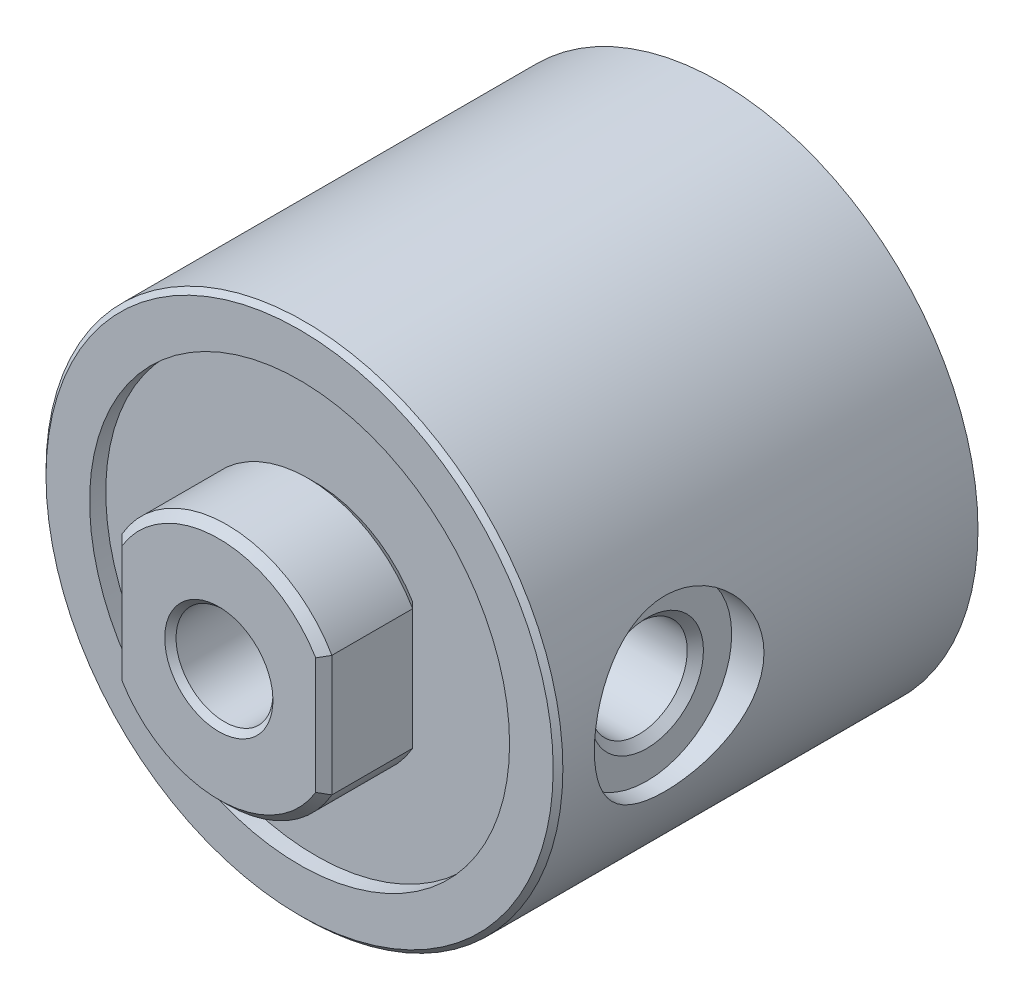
ISO-10303-21;
HEADER;
FILE_DESCRIPTION(('STEP AP214'),'2;1');
FILE_NAME('part.step','',(''),(''),'','','');
FILE_SCHEMA(('AUTOMOTIVE_DESIGN { 1 0 10303 214 1 1 1 1 }'));
ENDSEC;
DATA;
#1=APPLICATION_CONTEXT('core data for automotive mechanical design processes');
#2=APPLICATION_PROTOCOL_DEFINITION('international standard','automotive_design',2000,#1);
#3=PRODUCT_CONTEXT('',#1,'mechanical');
#4=PRODUCT('Part','Part','',(#3));
#5=PRODUCT_RELATED_PRODUCT_CATEGORY('part','',(#4));
#6=PRODUCT_DEFINITION_FORMATION('','',#4);
#7=PRODUCT_DEFINITION_CONTEXT('part definition',#1,'design');
#8=PRODUCT_DEFINITION('design','',#6,#7);
#9=PRODUCT_DEFINITION_SHAPE('','',#8);
#10=(LENGTH_UNIT() NAMED_UNIT(*) SI_UNIT(.MILLI.,.METRE.));
#11=(NAMED_UNIT(*) PLANE_ANGLE_UNIT() SI_UNIT($,.RADIAN.));
#12=(NAMED_UNIT(*) SI_UNIT($,.STERADIAN.) SOLID_ANGLE_UNIT());
#13=UNCERTAINTY_MEASURE_WITH_UNIT(LENGTH_MEASURE(1.E-05),#10,'distance_accuracy_value','');
#14=(GEOMETRIC_REPRESENTATION_CONTEXT(3) GLOBAL_UNCERTAINTY_ASSIGNED_CONTEXT((#13)) GLOBAL_UNIT_ASSIGNED_CONTEXT((#10,
#11,#12)) REPRESENTATION_CONTEXT('',''));
#15=CARTESIAN_POINT('',(0.,0.,0.));
#16=DIRECTION('',(0.,0.,1.));
#17=DIRECTION('',(1.,0.,0.));
#18=AXIS2_PLACEMENT_3D('',#15,#16,#17);
#19=CARTESIAN_POINT('',(6.,0.,18.5));
#20=DIRECTION('',(1.,0.,0.));
#21=DIRECTION('',(0.,0.,-1.));
#22=AXIS2_PLACEMENT_3D('',#19,#20,#21);
#23=CYLINDRICAL_SURFACE('',#22,5.25);
#24=CARTESIAN_POINT('',(14.,0.,18.5));
#25=DIRECTION('',(-1.,0.,0.));
#26=DIRECTION('',(0.,-1.,0.));
#27=AXIS2_PLACEMENT_3D('',#24,#25,#26);
#28=CIRCLE('',#27,5.25);
#29=CARTESIAN_POINT('',(14.,-5.25000000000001,18.5));
#30=VERTEX_POINT('',#29);
#31=EDGE_CURVE('E162',#30,#30,#28,.T.);
#32=ORIENTED_EDGE('',*,*,#31,.T.);
#33=EDGE_LOOP('',(#32));
#34=FACE_BOUND('',#33,.T.);
#35=CARTESIAN_POINT('',(16.,0.,13.25));
#36=CARTESIAN_POINT('',(16.0000001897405,-0.286709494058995,13.2499994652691));
#37=CARTESIAN_POINT('',(15.9922220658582,-0.573418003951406,13.2735628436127));
#38=CARTESIAN_POINT('',(15.9619585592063,-1.13840576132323,13.3669169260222));
#39=CARTESIAN_POINT('',(15.9394711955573,-1.41668386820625,13.4367138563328));
#40=CARTESIAN_POINT('',(15.8822364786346,-1.95658170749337,13.6198923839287));
#41=CARTESIAN_POINT('',(15.8475092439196,-2.21822794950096,13.7332024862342));
#42=CARTESIAN_POINT('',(15.7693480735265,-2.71880895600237,13.9998850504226));
#43=CARTESIAN_POINT('',(15.7259125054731,-2.95773945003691,14.15326502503));
#44=CARTESIAN_POINT('',(15.6332861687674,-3.41412925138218,14.5011154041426));
#45=CARTESIAN_POINT('',(15.5839607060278,-3.6307164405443,14.6966919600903));
#46=CARTESIAN_POINT('',(15.4858403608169,-4.02875232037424,15.121209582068));
#47=CARTESIAN_POINT('',(15.4370455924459,-4.21019359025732,15.3501576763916));
#48=CARTESIAN_POINT('',(15.3676517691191,-4.45451830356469,15.7175027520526));
#49=CARTESIAN_POINT('',(15.3448664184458,-4.5321901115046,15.8458879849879));
#50=CARTESIAN_POINT('',(15.301536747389,-4.67639137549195,16.1091118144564));
#51=CARTESIAN_POINT('',(15.2809915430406,-4.7429252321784,16.2439478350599));
#52=CARTESIAN_POINT('',(15.2427851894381,-4.86431443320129,16.5191964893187));
#53=CARTESIAN_POINT('',(15.2251245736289,-4.91916761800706,16.6596101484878));
#54=CARTESIAN_POINT('',(15.1932765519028,-5.01667019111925,16.9449330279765));
#55=CARTESIAN_POINT('',(15.1790875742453,-5.05932510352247,17.0898401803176));
#56=CARTESIAN_POINT('',(15.1550519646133,-5.13086527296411,17.37835336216));
#57=CARTESIAN_POINT('',(15.1450795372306,-5.16015188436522,17.521849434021));
#58=CARTESIAN_POINT('',(15.1291596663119,-5.20664321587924,17.8109495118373));
#59=CARTESIAN_POINT('',(15.123210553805,-5.22385294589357,17.9565526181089));
#60=CARTESIAN_POINT('',(15.1155308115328,-5.2460334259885,18.248790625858));
#61=CARTESIAN_POINT('',(15.1137999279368,-5.25100491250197,18.3954254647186));
#62=CARTESIAN_POINT('',(15.1146148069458,-5.24865901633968,18.6885827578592));
#63=CARTESIAN_POINT('',(15.1171604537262,-5.24134196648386,18.8351052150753));
#64=CARTESIAN_POINT('',(15.1262351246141,-5.21509263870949,19.1204141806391));
#65=CARTESIAN_POINT('',(15.1325824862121,-5.19668986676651,19.2592555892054));
#66=CARTESIAN_POINT('',(15.1489112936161,-5.1488953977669,19.5348641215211));
#67=CARTESIAN_POINT('',(15.1588939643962,-5.11949999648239,19.6716305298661));
#68=CARTESIAN_POINT('',(15.1821914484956,-5.04999045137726,19.9420764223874));
#69=CARTESIAN_POINT('',(15.1955053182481,-5.00987934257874,20.0757567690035));
#70=CARTESIAN_POINT('',(15.2250851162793,-4.91925343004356,20.3392574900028));
#71=CARTESIAN_POINT('',(15.2413521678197,-4.86873466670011,20.469076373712));
#72=CARTESIAN_POINT('',(15.2766495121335,-4.7568341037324,20.7259719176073));
#73=CARTESIAN_POINT('',(15.2957183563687,-4.69529758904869,20.8529759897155));
#74=CARTESIAN_POINT('',(15.3358955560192,-4.56236027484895,21.1013928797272));
#75=CARTESIAN_POINT('',(15.3570046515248,-4.49095589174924,21.2228036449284));
#76=CARTESIAN_POINT('',(15.422542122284,-4.26265776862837,21.5775304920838));
#77=CARTESIAN_POINT('',(15.4692078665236,-4.09159662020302,21.8015294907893));
#78=CARTESIAN_POINT('',(15.5660589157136,-3.70662777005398,22.2296799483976));
#79=CARTESIAN_POINT('',(15.6163029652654,-3.49099291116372,22.4322584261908));
#80=CARTESIAN_POINT('',(15.7126062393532,-3.02816716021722,22.798813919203));
#81=CARTESIAN_POINT('',(15.7586650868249,-2.78097342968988,22.9627874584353));
#82=CARTESIAN_POINT('',(15.8419744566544,-2.25882664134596,23.2486414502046));
#83=CARTESIAN_POINT('',(15.8791385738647,-1.98363559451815,23.3701139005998));
#84=CARTESIAN_POINT('',(15.9398466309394,-1.41521430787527,23.5645637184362));
#85=CARTESIAN_POINT('',(15.9633951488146,-1.121990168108,23.6375573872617));
#86=CARTESIAN_POINT('',(15.9934654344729,-0.539099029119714,23.7302264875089));
#87=CARTESIAN_POINT('',(16.0006630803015,-0.24980309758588,23.7520197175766));
#88=CARTESIAN_POINT('',(15.9992404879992,0.328362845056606,23.747686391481));
#89=CARTESIAN_POINT('',(15.9906228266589,0.617232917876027,23.7215676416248));
#90=CARTESIAN_POINT('',(15.958984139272,1.17794733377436,23.6238366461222));
#91=CARTESIAN_POINT('',(15.9363716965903,1.45004183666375,23.5535140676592));
#92=CARTESIAN_POINT('',(15.8794304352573,1.97847602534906,23.3709640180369));
#93=CARTESIAN_POINT('',(15.8451001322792,2.2348137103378,23.2587312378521));
#94=CARTESIAN_POINT('',(15.7671241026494,2.73180727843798,22.9923622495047));
#95=CARTESIAN_POINT('',(15.7232605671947,2.97188670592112,22.8372180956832));
#96=CARTESIAN_POINT('',(15.6311726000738,3.42338661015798,22.4904754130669));
#97=CARTESIAN_POINT('',(15.5829468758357,3.6347985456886,22.2988660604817));
#98=CARTESIAN_POINT('',(15.5099889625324,3.93080686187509,21.9832982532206));
#99=CARTESIAN_POINT('',(15.4850337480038,4.02775652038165,21.8707214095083));
#100=CARTESIAN_POINT('',(15.4359782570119,4.21184399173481,21.6376565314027));
#101=CARTESIAN_POINT('',(15.4118776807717,4.29898526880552,21.5171713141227));
#102=CARTESIAN_POINT('',(15.3652178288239,4.46288622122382,21.2689852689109));
#103=CARTESIAN_POINT('',(15.3426592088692,4.5396414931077,21.1412814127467));
#104=CARTESIAN_POINT('',(15.2997778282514,4.68212907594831,20.8795698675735));
#105=CARTESIAN_POINT('',(15.2794541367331,4.74786598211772,20.7455648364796));
#106=CARTESIAN_POINT('',(15.2417045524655,4.86768768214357,20.4723882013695));
#107=CARTESIAN_POINT('',(15.2242726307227,4.92179679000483,20.3332281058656));
#108=CARTESIAN_POINT('',(15.1928226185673,5.01803804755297,20.0505099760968));
#109=CARTESIAN_POINT('',(15.1788031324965,5.06017509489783,19.9069537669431));
#110=CARTESIAN_POINT('',(15.1546390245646,5.13209093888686,19.6164790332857));
#111=CARTESIAN_POINT('',(15.1444937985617,5.16187166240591,19.4695610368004));
#112=CARTESIAN_POINT('',(15.1284251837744,5.20877809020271,19.1734921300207));
#113=CARTESIAN_POINT('',(15.1225015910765,5.22590440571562,19.0243413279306));
#114=CARTESIAN_POINT('',(15.1152688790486,5.24678567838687,18.7325064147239));
#115=CARTESIAN_POINT('',(15.1137437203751,5.25116674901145,18.5898721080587));
#116=CARTESIAN_POINT('',(15.1147381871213,5.24830378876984,18.3046839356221));
#117=CARTESIAN_POINT('',(15.1172591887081,5.24105580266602,18.1621301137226));
#118=CARTESIAN_POINT('',(15.1262661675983,5.21500339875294,17.8782731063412));
#119=CARTESIAN_POINT('',(15.1327504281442,5.19620398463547,17.7369694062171));
#120=CARTESIAN_POINT('',(15.1494797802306,5.1472255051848,17.4565239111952));
#121=CARTESIAN_POINT('',(15.159726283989,5.11704216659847,17.3173829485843));
#122=CARTESIAN_POINT('',(15.1834458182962,5.04622046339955,17.044796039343));
#123=CARTESIAN_POINT('',(15.1968565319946,5.00578302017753,16.9112924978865));
#124=CARTESIAN_POINT('',(15.2266068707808,4.91454331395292,16.6481951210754));
#125=CARTESIAN_POINT('',(15.2429475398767,4.86373735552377,16.5186026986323));
#126=CARTESIAN_POINT('',(15.2956907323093,4.69633894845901,16.1369666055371));
#127=CARTESIAN_POINT('',(15.335834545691,4.56470890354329,15.8918461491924));
#128=CARTESIAN_POINT('',(15.4236656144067,4.25873630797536,15.416320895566));
#129=CARTESIAN_POINT('',(15.4716009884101,4.08281598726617,15.1869845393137));
#130=CARTESIAN_POINT('',(15.5685600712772,3.69589864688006,14.760243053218));
#131=CARTESIAN_POINT('',(15.6175840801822,3.48489185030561,14.562846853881));
#132=CARTESIAN_POINT('',(15.7133890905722,3.02434678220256,14.1982256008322));
#133=CARTESIAN_POINT('',(15.7600181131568,2.77366444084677,14.0324013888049));
#134=CARTESIAN_POINT('',(15.8437522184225,2.24646513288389,13.7454351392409));
#135=CARTESIAN_POINT('',(15.8808600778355,1.969955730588,13.6242800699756));
#136=CARTESIAN_POINT('',(15.9396537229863,1.41459012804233,13.4361463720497));
#137=CARTESIAN_POINT('',(15.9620741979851,1.13669576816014,13.3665591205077));
#138=CARTESIAN_POINT('',(15.9922453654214,0.572532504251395,13.2734920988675));
#139=CARTESIAN_POINT('',(15.9999998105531,0.286265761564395,13.2500005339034));
#140=CARTESIAN_POINT('',(16.,0.,13.25));
#141=B_SPLINE_CURVE_WITH_KNOTS('',3,(#35,#36,#37,#38,#39,#40,#41,#42,#43,#44,#45,#46,#47,#48,
#49,#50,#51,#52,#53,#54,#55,#56,#57,#58,#59,#60,#61,#62,#63,#64,#65,#66,#67,#68,#69,#70,#71,#72,
#73,#74,#75,#76,#77,#78,#79,#80,#81,#82,#83,#84,#85,#86,#87,#88,#89,#90,#91,#92,#93,#94,#95,#96,
#97,#98,#99,#100,#101,#102,#103,#104,#105,#106,#107,#108,#109,#110,#111,#112,#113,#114,#115,
#116,#117,#118,#119,#120,#121,#122,#123,#124,#125,#126,#127,#128,#129,#130,#131,#132,#133,#134,
#135,#136,#137,#138,#139,#140),.UNSPECIFIED.,.T.,.F.,(4,2,2,2,2,2,2,2,2,2,2,2,2,2,2,2,2,2,2,2,2,
2,2,2,2,2,2,2,2,2,2,2,2,2,2,2,2,2,2,2,2,2,2,2,2,2,2,2,2,2,2,2,4),(0.,0.859075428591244,
1.71826657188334,2.57605200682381,3.43399838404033,4.31799257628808,5.20217321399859,
5.65702442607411,6.11169549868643,6.56645055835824,7.02099935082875,7.46082097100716,
7.90046003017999,8.34007263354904,8.77967333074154,9.19977850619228,9.62002537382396,
10.0401533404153,10.4604414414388,10.8871751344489,11.3140642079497,12.1672273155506,
13.0634636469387,13.9597806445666,14.8644801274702,15.7688752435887,16.6351478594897,
17.5012793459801,18.3432445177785,19.1853163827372,20.0491497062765,20.9132398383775,
21.3647510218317,21.8161022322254,22.2676442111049,22.7189974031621,23.1693974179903,
23.6196129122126,24.0697581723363,24.5198816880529,24.9474850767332,25.3752339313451,
25.8027976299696,26.2305219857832,26.6504379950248,27.0705039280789,27.9099651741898,
28.7851100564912,29.6604992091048,30.5685564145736,31.476348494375,32.3343139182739,
33.1920597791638),.UNSPECIFIED.);
#142=CARTESIAN_POINT('',(16.,0.,13.25));
#143=VERTEX_POINT('',#142);
#144=EDGE_CURVE('E158',#143,#143,#141,.T.);
#145=ORIENTED_EDGE('',*,*,#144,.F.);
#146=EDGE_LOOP('',(#145));
#147=FACE_BOUND('',#146,.T.);
#148=ADVANCED_FACE('F14',(#34,#147),#23,.F.);
#149=CARTESIAN_POINT('',(14.,0.,18.5));
#150=DIRECTION('',(-1.,0.,0.));
#151=DIRECTION('',(0.,-1.,0.));
#152=AXIS2_PLACEMENT_3D('',#149,#150,#151);
#153=PLANE('',#152);
#154=CARTESIAN_POINT('',(14.,0.,18.5));
#155=DIRECTION('',(1.,0.,0.));
#156=DIRECTION('',(0.,-1.,0.));
#157=AXIS2_PLACEMENT_3D('',#154,#155,#156);
#158=CIRCLE('',#157,3.5);
#159=CARTESIAN_POINT('',(14.,-3.50000000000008,18.5));
#160=VERTEX_POINT('',#159);
#161=EDGE_CURVE('E163',#160,#160,#158,.F.);
#162=ORIENTED_EDGE('',*,*,#161,.T.);
#163=EDGE_LOOP('',(#162));
#164=FACE_BOUND('',#163,.T.);
#165=ORIENTED_EDGE('',*,*,#31,.F.);
#166=EDGE_LOOP('',(#165));
#167=FACE_BOUND('',#166,.T.);
#168=ADVANCED_FACE('F199',(#164,#167),#153,.F.);
#169=CARTESIAN_POINT('',(0.,0.,31.));
#170=DIRECTION('',(0.,0.,1.));
#171=DIRECTION('',(0.,-1.,0.));
#172=AXIS2_PLACEMENT_3D('',#169,#170,#171);
#173=CONICAL_SURFACE('',#172,3.35,0.785398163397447);
#174=CARTESIAN_POINT('',(0.,0.,30.65));
#175=DIRECTION('',(0.,0.,1.));
#176=DIRECTION('',(-1.,0.,0.));
#177=AXIS2_PLACEMENT_3D('',#174,#175,#176);
#178=CIRCLE('',#177,3.);
#179=CARTESIAN_POINT('',(-3.,0.,30.65));
#180=VERTEX_POINT('',#179);
#181=EDGE_CURVE('E18',#180,#180,#178,.F.);
#182=ORIENTED_EDGE('',*,*,#181,.T.);
#183=EDGE_LOOP('',(#182));
#184=FACE_BOUND('',#183,.T.);
#185=CARTESIAN_POINT('',(0.,0.,31.));
#186=DIRECTION('',(0.,0.,1.));
#187=DIRECTION('',(0.,-1.,0.));
#188=AXIS2_PLACEMENT_3D('',#185,#186,#187);
#189=CIRCLE('',#188,3.35);
#190=CARTESIAN_POINT('',(0.,-3.35,31.));
#191=VERTEX_POINT('',#190);
#192=EDGE_CURVE('E165',#191,#191,#189,.T.);
#193=ORIENTED_EDGE('',*,*,#192,.T.);
#194=EDGE_LOOP('',(#193));
#195=FACE_BOUND('',#194,.T.);
#196=ADVANCED_FACE('F227',(#184,#195),#173,.F.);
#197=CARTESIAN_POINT('',(0.,-7.5,31.));
#198=DIRECTION('',(0.,0.,-1.));
#199=DIRECTION('',(0.,1.,0.));
#200=AXIS2_PLACEMENT_3D('',#197,#198,#199);
#201=PLANE('',#200);
#202=ORIENTED_EDGE('',*,*,#192,.F.);
#203=EDGE_LOOP('',(#202));
#204=FACE_BOUND('',#203,.T.);
#205=CARTESIAN_POINT('',(0.,0.,31.));
#206=DIRECTION('',(0.,0.,-1.));
#207=DIRECTION('',(0.,1.,0.));
#208=AXIS2_PLACEMENT_3D('',#205,#206,#207);
#209=CIRCLE('',#208,7.);
#210=CARTESIAN_POINT('',(-6.,-3.60555127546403,31.));
#211=VERTEX_POINT('',#210);
#212=CARTESIAN_POINT('',(6.,-3.60555127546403,31.));
#213=VERTEX_POINT('',#212);
#214=EDGE_CURVE('E120',#211,#213,#209,.F.);
#215=ORIENTED_EDGE('',*,*,#214,.T.);
#216=DIRECTION('',(0.,1.,0.));
#217=VECTOR('',#216,1.);
#218=CARTESIAN_POINT('',(6.,-7.5,31.));
#219=LINE('',#218,#217);
#220=CARTESIAN_POINT('',(6.,3.60555127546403,31.));
#221=VERTEX_POINT('',#220);
#222=EDGE_CURVE('E104',#213,#221,#219,.T.);
#223=ORIENTED_EDGE('',*,*,#222,.T.);
#224=CARTESIAN_POINT('',(0.,0.,31.));
#225=DIRECTION('',(0.,0.,-1.));
#226=DIRECTION('',(0.,1.,0.));
#227=AXIS2_PLACEMENT_3D('',#224,#225,#226);
#228=CIRCLE('',#227,7.);
#229=CARTESIAN_POINT('',(-6.,3.60555127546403,31.));
#230=VERTEX_POINT('',#229);
#231=EDGE_CURVE('E127',#221,#230,#228,.F.);
#232=ORIENTED_EDGE('',*,*,#231,.T.);
#233=DIRECTION('',(0.,-1.,0.));
#234=VECTOR('',#233,1.);
#235=CARTESIAN_POINT('',(-6.,-7.5,31.));
#236=LINE('',#235,#234);
#237=EDGE_CURVE('E122',#230,#211,#236,.T.);
#238=ORIENTED_EDGE('',*,*,#237,.T.);
#239=EDGE_LOOP('',(#215,#223,#232,#238));
#240=FACE_BOUND('',#239,.T.);
#241=ADVANCED_FACE('F233',(#204,#240),#201,.F.);
#242=CARTESIAN_POINT('',(6.5,7.41559238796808,30.5));
#243=DIRECTION('',(-0.707106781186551,0.,-0.707106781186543));
#244=DIRECTION('',(0.707106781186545,0.,-0.707106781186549));
#245=AXIS2_PLACEMENT_3D('',#242,#243,#244);
#246=PLANE('',#245);
#247=CARTESIAN_POINT('',(6.,3.60555127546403,31.));
#248=CARTESIAN_POINT('',(6.08327819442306,3.62864080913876,30.9167218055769));
#249=CARTESIAN_POINT('',(6.16658396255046,3.65152775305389,30.8334160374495));
#250=CARTESIAN_POINT('',(6.33325062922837,3.6968964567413,30.6667493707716));
#251=CARTESIAN_POINT('',(6.41661152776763,3.71937821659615,30.5833884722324));
#252=CARTESIAN_POINT('',(6.5,3.741657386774,30.5));
#253=B_SPLINE_CURVE_WITH_KNOTS('',3,(#247,#248,#249,#250,#251,#252),.UNSPECIFIED.,.F.,.F.,(4,2,
4),(0.,0.360043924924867,0.720087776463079),.UNSPECIFIED.);
#254=CARTESIAN_POINT('',(6.5,3.74165738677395,30.5));
#255=VERTEX_POINT('',#254);
#256=EDGE_CURVE('E107',#255,#221,#253,.F.);
#257=ORIENTED_EDGE('',*,*,#256,.T.);
#258=ORIENTED_EDGE('',*,*,#222,.F.);
#259=CARTESIAN_POINT('',(6.5,-3.74165738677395,30.5));
#260=CARTESIAN_POINT('',(6.41661152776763,-3.71937821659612,30.5833884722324));
#261=CARTESIAN_POINT('',(6.33325062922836,-3.69689645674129,30.6667493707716));
#262=CARTESIAN_POINT('',(6.16658396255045,-3.65152775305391,30.8334160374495));
#263=CARTESIAN_POINT('',(6.08327819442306,-3.62864080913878,30.9167218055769));
#264=CARTESIAN_POINT('',(6.,-3.60555127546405,31.));
#265=B_SPLINE_CURVE_WITH_KNOTS('',3,(#259,#260,#261,#262,#263,#264),.UNSPECIFIED.,.F.,.F.,(4,2,
4),(0.,0.360043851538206,0.720087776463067),.UNSPECIFIED.);
#266=CARTESIAN_POINT('',(6.5,-3.74165738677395,30.5));
#267=VERTEX_POINT('',#266);
#268=EDGE_CURVE('E100',#213,#267,#265,.F.);
#269=ORIENTED_EDGE('',*,*,#268,.T.);
#270=DIRECTION('',(0.,-1.,0.));
#271=VECTOR('',#270,1.);
#272=CARTESIAN_POINT('',(6.5,7.41559238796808,30.5));
#273=LINE('',#272,#271);
#274=EDGE_CURVE('E102',#255,#267,#273,.T.);
#275=ORIENTED_EDGE('',*,*,#274,.F.);
#276=EDGE_LOOP('',(#257,#258,#269,#275));
#277=FACE_BOUND('',#276,.T.);
#278=ADVANCED_FACE('F101',(#277),#246,.F.);
#279=CARTESIAN_POINT('',(0.,0.,30.5));
#280=DIRECTION('',(0.,0.,-1.));
#281=DIRECTION('',(0.,1.,0.));
#282=AXIS2_PLACEMENT_3D('',#279,#280,#281);
#283=CONICAL_SURFACE('',#282,7.5,0.785398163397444);
#284=CARTESIAN_POINT('',(-6.,3.60555127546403,31.));
#285=CARTESIAN_POINT('',(-6.08327819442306,3.62864080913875,30.9167218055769));
#286=CARTESIAN_POINT('',(-6.16658396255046,3.65152775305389,30.8334160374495));
#287=CARTESIAN_POINT('',(-6.33325062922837,3.6968964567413,30.6667493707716));
#288=CARTESIAN_POINT('',(-6.41661152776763,3.71937821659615,30.5833884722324));
#289=CARTESIAN_POINT('',(-6.5,3.741657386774,30.5));
#290=B_SPLINE_CURVE_WITH_KNOTS('',3,(#284,#285,#286,#287,#288,#289),.UNSPECIFIED.,.F.,.F.,(4,2,
4),(0.,0.360043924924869,0.720087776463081),.UNSPECIFIED.);
#291=CARTESIAN_POINT('',(-6.5,3.74165738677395,30.5));
#292=VERTEX_POINT('',#291);
#293=EDGE_CURVE('E289',#292,#230,#290,.F.);
#294=ORIENTED_EDGE('',*,*,#293,.T.);
#295=ORIENTED_EDGE('',*,*,#231,.F.);
#296=ORIENTED_EDGE('',*,*,#256,.F.);
#297=CARTESIAN_POINT('',(0.,0.,30.5));
#298=DIRECTION('',(0.,0.,-1.));
#299=DIRECTION('',(0.,1.,0.));
#300=AXIS2_PLACEMENT_3D('',#297,#298,#299);
#301=CIRCLE('',#300,7.5);
#302=EDGE_CURVE('E130',#292,#255,#301,.T.);
#303=ORIENTED_EDGE('',*,*,#302,.F.);
#304=EDGE_LOOP('',(#294,#295,#296,#303));
#305=FACE_BOUND('',#304,.T.);
#306=ADVANCED_FACE('F276',(#305),#283,.T.);
#307=CARTESIAN_POINT('',(-6.5,7.41559238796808,30.5));
#308=DIRECTION('',(0.707106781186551,0.,-0.707106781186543));
#309=DIRECTION('',(0.707106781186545,0.,0.707106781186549));
#310=AXIS2_PLACEMENT_3D('',#307,#308,#309);
#311=PLANE('',#310);
#312=CARTESIAN_POINT('',(-6.,-3.60555127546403,31.));
#313=CARTESIAN_POINT('',(-6.08327819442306,-3.62864080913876,30.9167218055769));
#314=CARTESIAN_POINT('',(-6.16658396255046,-3.65152775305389,30.8334160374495));
#315=CARTESIAN_POINT('',(-6.33325062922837,-3.69689645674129,30.6667493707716));
#316=CARTESIAN_POINT('',(-6.41661152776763,-3.71937821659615,30.5833884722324));
#317=CARTESIAN_POINT('',(-6.5,-3.741657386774,30.5));
#318=B_SPLINE_CURVE_WITH_KNOTS('',3,(#312,#313,#314,#315,#316,#317),.UNSPECIFIED.,.F.,.F.,(4,2,
4),(0.,0.360043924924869,0.720087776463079),.UNSPECIFIED.);
#319=CARTESIAN_POINT('',(-6.5,-3.74165738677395,30.5));
#320=VERTEX_POINT('',#319);
#321=EDGE_CURVE('E113',#211,#320,#318,.T.);
#322=ORIENTED_EDGE('',*,*,#321,.F.);
#323=ORIENTED_EDGE('',*,*,#237,.F.);
#324=ORIENTED_EDGE('',*,*,#293,.F.);
#325=DIRECTION('',(0.,1.,0.));
#326=VECTOR('',#325,1.);
#327=CARTESIAN_POINT('',(-6.5,7.41559238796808,30.5));
#328=LINE('',#327,#326);
#329=EDGE_CURVE('E115',#320,#292,#328,.T.);
#330=ORIENTED_EDGE('',*,*,#329,.F.);
#331=EDGE_LOOP('',(#322,#323,#324,#330));
#332=FACE_BOUND('',#331,.T.);
#333=ADVANCED_FACE('F253',(#332),#311,.F.);
#334=CARTESIAN_POINT('',(0.,0.,30.5));
#335=DIRECTION('',(0.,0.,-1.));
#336=DIRECTION('',(0.,1.,0.));
#337=AXIS2_PLACEMENT_3D('',#334,#335,#336);
#338=CONICAL_SURFACE('',#337,7.5,0.785398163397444);
#339=ORIENTED_EDGE('',*,*,#321,.T.);
#340=CARTESIAN_POINT('',(0.,0.,30.5));
#341=DIRECTION('',(0.,0.,-1.));
#342=DIRECTION('',(0.,1.,0.));
#343=AXIS2_PLACEMENT_3D('',#340,#341,#342);
#344=CIRCLE('',#343,7.5);
#345=EDGE_CURVE('E86',#267,#320,#344,.T.);
#346=ORIENTED_EDGE('',*,*,#345,.F.);
#347=ORIENTED_EDGE('',*,*,#268,.F.);
#348=ORIENTED_EDGE('',*,*,#214,.F.);
#349=EDGE_LOOP('',(#339,#346,#347,#348));
#350=FACE_BOUND('',#349,.T.);
#351=ADVANCED_FACE('F111',(#350),#338,.T.);
#352=CARTESIAN_POINT('',(6.5,7.41559238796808,-0.499999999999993));
#353=DIRECTION('',(-1.,0.,0.));
#354=DIRECTION('',(0.,0.,-1.));
#355=AXIS2_PLACEMENT_3D('',#352,#353,#354);
#356=PLANE('',#355);
#357=DIRECTION('',(0.,0.,-1.));
#358=VECTOR('',#357,1.);
#359=CARTESIAN_POINT('',(6.5,-3.74165738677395,-0.499999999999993));
#360=LINE('',#359,#358);
#361=CARTESIAN_POINT('',(6.5,-3.74165738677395,25.5));
#362=VERTEX_POINT('',#361);
#363=EDGE_CURVE('E82',#362,#267,#360,.F.);
#364=ORIENTED_EDGE('',*,*,#363,.F.);
#365=DIRECTION('',(0.,1.,0.));
#366=VECTOR('',#365,1.);
#367=CARTESIAN_POINT('',(6.5,7.41559238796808,25.5));
#368=LINE('',#367,#366);
#369=CARTESIAN_POINT('',(6.5,3.74165738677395,25.5));
#370=VERTEX_POINT('',#369);
#371=EDGE_CURVE('E144',#362,#370,#368,.T.);
#372=ORIENTED_EDGE('',*,*,#371,.T.);
#373=DIRECTION('',(0.,0.,-1.));
#374=VECTOR('',#373,1.);
#375=CARTESIAN_POINT('',(6.5,3.74165738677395,-0.499999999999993));
#376=LINE('',#375,#374);
#377=EDGE_CURVE('E93',#255,#370,#376,.T.);
#378=ORIENTED_EDGE('',*,*,#377,.F.);
#379=ORIENTED_EDGE('',*,*,#274,.T.);
#380=EDGE_LOOP('',(#364,#372,#378,#379));
#381=FACE_BOUND('',#380,.T.);
#382=ADVANCED_FACE('F118',(#381),#356,.F.);
#383=CARTESIAN_POINT('',(0.,0.,-0.499999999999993));
#384=DIRECTION('',(0.,0.,-1.));
#385=DIRECTION('',(0.,1.,0.));
#386=AXIS2_PLACEMENT_3D('',#383,#384,#385);
#387=CYLINDRICAL_SURFACE('',#386,7.5);
#388=ORIENTED_EDGE('',*,*,#377,.T.);
#389=CARTESIAN_POINT('',(0.,0.,25.5));
#390=DIRECTION('',(0.,0.,1.));
#391=DIRECTION('',(0.,-1.,0.));
#392=AXIS2_PLACEMENT_3D('',#389,#390,#391);
#393=CIRCLE('',#392,7.5);
#394=CARTESIAN_POINT('',(-6.5,3.74165738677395,25.5));
#395=VERTEX_POINT('',#394);
#396=EDGE_CURVE('E39',#370,#395,#393,.T.);
#397=ORIENTED_EDGE('',*,*,#396,.T.);
#398=DIRECTION('',(0.,0.,-1.));
#399=VECTOR('',#398,1.);
#400=CARTESIAN_POINT('',(-6.5,3.74165738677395,-0.499999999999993));
#401=LINE('',#400,#399);
#402=EDGE_CURVE('E296',#395,#292,#401,.F.);
#403=ORIENTED_EDGE('',*,*,#402,.T.);
#404=ORIENTED_EDGE('',*,*,#302,.T.);
#405=EDGE_LOOP('',(#388,#397,#403,#404));
#406=FACE_BOUND('',#405,.T.);
#407=ADVANCED_FACE('F254',(#406),#387,.T.);
#408=CARTESIAN_POINT('',(-6.5,7.41559238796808,-0.499999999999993));
#409=DIRECTION('',(1.,0.,0.));
#410=DIRECTION('',(0.,0.,1.));
#411=AXIS2_PLACEMENT_3D('',#408,#409,#410);
#412=PLANE('',#411);
#413=ORIENTED_EDGE('',*,*,#402,.F.);
#414=DIRECTION('',(0.,-1.,0.));
#415=VECTOR('',#414,1.);
#416=CARTESIAN_POINT('',(-6.5,7.41559238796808,25.5));
#417=LINE('',#416,#415);
#418=CARTESIAN_POINT('',(-6.5,-3.74165738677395,25.5));
#419=VERTEX_POINT('',#418);
#420=EDGE_CURVE('E31',#395,#419,#417,.T.);
#421=ORIENTED_EDGE('',*,*,#420,.T.);
#422=DIRECTION('',(0.,0.,-1.));
#423=VECTOR('',#422,1.);
#424=CARTESIAN_POINT('',(-6.5,-3.74165738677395,-0.499999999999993));
#425=LINE('',#424,#423);
#426=EDGE_CURVE('E94',#320,#419,#425,.T.);
#427=ORIENTED_EDGE('',*,*,#426,.F.);
#428=ORIENTED_EDGE('',*,*,#329,.T.);
#429=EDGE_LOOP('',(#413,#421,#427,#428));
#430=FACE_BOUND('',#429,.T.);
#431=ADVANCED_FACE('F257',(#430),#412,.F.);
#432=ORIENTED_EDGE('',*,*,#426,.T.);
#433=CARTESIAN_POINT('',(0.,0.,25.5));
#434=DIRECTION('',(0.,0.,1.));
#435=DIRECTION('',(0.,-1.,0.));
#436=AXIS2_PLACEMENT_3D('',#433,#434,#435);
#437=CIRCLE('',#436,7.5);
#438=EDGE_CURVE('E88',#419,#362,#437,.T.);
#439=ORIENTED_EDGE('',*,*,#438,.T.);
#440=ORIENTED_EDGE('',*,*,#363,.T.);
#441=ORIENTED_EDGE('',*,*,#345,.T.);
#442=EDGE_LOOP('',(#432,#439,#440,#441));
#443=FACE_BOUND('',#442,.T.);
#444=ADVANCED_FACE('F84',(#443),#387,.T.);
#445=CARTESIAN_POINT('',(6.,-4.5,25.));
#446=DIRECTION('',(-0.70710678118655,0.,0.707106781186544));
#447=DIRECTION('',(-0.707106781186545,0.,-0.707106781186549));
#448=AXIS2_PLACEMENT_3D('',#445,#446,#447);
#449=PLANE('',#448);
#450=CARTESIAN_POINT('',(6.5,3.74165738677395,25.5));
#451=CARTESIAN_POINT('',(6.41661152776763,3.71937821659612,25.4166115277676));
#452=CARTESIAN_POINT('',(6.33325062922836,3.69689645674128,25.3332506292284));
#453=CARTESIAN_POINT('',(6.16658396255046,3.6515277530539,25.1665839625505));
#454=CARTESIAN_POINT('',(6.08327819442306,3.62864080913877,25.0832781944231));
#455=CARTESIAN_POINT('',(6.,3.60555127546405,25.));
#456=B_SPLINE_CURVE_WITH_KNOTS('',3,(#450,#451,#452,#453,#454,#455),.UNSPECIFIED.,.F.,.F.,(4,2,
4),(0.,0.360043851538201,0.720087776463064),.UNSPECIFIED.);
#457=CARTESIAN_POINT('',(6.,3.60555127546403,25.));
#458=VERTEX_POINT('',#457);
#459=EDGE_CURVE('E307',#458,#370,#456,.F.);
#460=ORIENTED_EDGE('',*,*,#459,.T.);
#461=ORIENTED_EDGE('',*,*,#371,.F.);
#462=CARTESIAN_POINT('',(6.,-3.60555127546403,25.));
#463=CARTESIAN_POINT('',(6.08327819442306,-3.62864080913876,25.0832781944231));
#464=CARTESIAN_POINT('',(6.16658396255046,-3.65152775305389,25.1665839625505));
#465=CARTESIAN_POINT('',(6.33325062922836,-3.6968964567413,25.3332506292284));
#466=CARTESIAN_POINT('',(6.41661152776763,-3.71937821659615,25.4166115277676));
#467=CARTESIAN_POINT('',(6.5,-3.741657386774,25.5));
#468=B_SPLINE_CURVE_WITH_KNOTS('',3,(#462,#463,#464,#465,#466,#467),.UNSPECIFIED.,.F.,.F.,(4,2,
4),(0.,0.360043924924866,0.720087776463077),.UNSPECIFIED.);
#469=CARTESIAN_POINT('',(6.,-3.60555127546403,25.));
#470=VERTEX_POINT('',#469);
#471=EDGE_CURVE('E311',#362,#470,#468,.F.);
#472=ORIENTED_EDGE('',*,*,#471,.T.);
#473=DIRECTION('',(0.,-1.,0.));
#474=VECTOR('',#473,1.);
#475=CARTESIAN_POINT('',(6.,-4.5,25.));
#476=LINE('',#475,#474);
#477=EDGE_CURVE('E141',#458,#470,#476,.T.);
#478=ORIENTED_EDGE('',*,*,#477,.F.);
#479=EDGE_LOOP('',(#460,#461,#472,#478));
#480=FACE_BOUND('',#479,.T.);
#481=ADVANCED_FACE('F213',(#480),#449,.F.);
#482=CARTESIAN_POINT('',(0.,0.,25.));
#483=DIRECTION('',(0.,0.,1.));
#484=DIRECTION('',(0.,-1.,0.));
#485=AXIS2_PLACEMENT_3D('',#482,#483,#484);
#486=CONICAL_SURFACE('',#485,7.,0.785398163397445);
#487=CARTESIAN_POINT('',(-6.5,3.74165738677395,25.5));
#488=CARTESIAN_POINT('',(-6.41661152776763,3.71937821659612,25.4166115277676));
#489=CARTESIAN_POINT('',(-6.33325062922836,3.69689645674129,25.3332506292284));
#490=CARTESIAN_POINT('',(-6.16658396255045,3.65152775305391,25.1665839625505));
#491=CARTESIAN_POINT('',(-6.08327819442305,3.62864080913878,25.0832781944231));
#492=CARTESIAN_POINT('',(-6.,3.60555127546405,25.));
#493=B_SPLINE_CURVE_WITH_KNOTS('',3,(#487,#488,#489,#490,#491,#492),.UNSPECIFIED.,.F.,.F.,(4,2,
4),(0.,0.360043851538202,0.720087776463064),.UNSPECIFIED.);
#494=CARTESIAN_POINT('',(-6.,3.60555127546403,25.));
#495=VERTEX_POINT('',#494);
#496=EDGE_CURVE('E108',#495,#395,#493,.F.);
#497=ORIENTED_EDGE('',*,*,#496,.T.);
#498=ORIENTED_EDGE('',*,*,#396,.F.);
#499=ORIENTED_EDGE('',*,*,#459,.F.);
#500=CARTESIAN_POINT('',(0.,0.,25.));
#501=DIRECTION('',(0.,0.,1.));
#502=DIRECTION('',(0.,-1.,0.));
#503=AXIS2_PLACEMENT_3D('',#500,#501,#502);
#504=CIRCLE('',#503,7.);
#505=EDGE_CURVE('E138',#495,#458,#504,.F.);
#506=ORIENTED_EDGE('',*,*,#505,.F.);
#507=EDGE_LOOP('',(#497,#498,#499,#506));
#508=FACE_BOUND('',#507,.T.);
#509=ADVANCED_FACE('F270',(#508),#486,.T.);
#510=CARTESIAN_POINT('',(-6.,-4.5,25.));
#511=DIRECTION('',(0.70710678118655,0.,0.707106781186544));
#512=DIRECTION('',(-0.707106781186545,0.,0.707106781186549));
#513=AXIS2_PLACEMENT_3D('',#510,#511,#512);
#514=PLANE('',#513);
#515=CARTESIAN_POINT('',(-6.5,-3.74165738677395,25.5));
#516=CARTESIAN_POINT('',(-6.41661152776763,-3.71937821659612,25.4166115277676));
#517=CARTESIAN_POINT('',(-6.33325062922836,-3.69689645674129,25.3332506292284));
#518=CARTESIAN_POINT('',(-6.16658396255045,-3.65152775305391,25.1665839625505));
#519=CARTESIAN_POINT('',(-6.08327819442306,-3.62864080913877,25.0832781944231));
#520=CARTESIAN_POINT('',(-6.,-3.60555127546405,25.));
#521=B_SPLINE_CURVE_WITH_KNOTS('',3,(#515,#516,#517,#518,#519,#520),.UNSPECIFIED.,.F.,.F.,(4,2,
4),(0.,0.360043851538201,0.720087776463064),.UNSPECIFIED.);
#522=CARTESIAN_POINT('',(-6.,-3.60555127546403,25.));
#523=VERTEX_POINT('',#522);
#524=EDGE_CURVE('E302',#419,#523,#521,.T.);
#525=ORIENTED_EDGE('',*,*,#524,.F.);
#526=ORIENTED_EDGE('',*,*,#420,.F.);
#527=ORIENTED_EDGE('',*,*,#496,.F.);
#528=DIRECTION('',(0.,1.,0.));
#529=VECTOR('',#528,1.);
#530=CARTESIAN_POINT('',(-6.,-4.5,25.));
#531=LINE('',#530,#529);
#532=EDGE_CURVE('E136',#523,#495,#531,.T.);
#533=ORIENTED_EDGE('',*,*,#532,.F.);
#534=EDGE_LOOP('',(#525,#526,#527,#533));
#535=FACE_BOUND('',#534,.T.);
#536=ADVANCED_FACE('F303',(#535),#514,.F.);
#537=CARTESIAN_POINT('',(0.,0.,25.));
#538=DIRECTION('',(0.,0.,1.));
#539=DIRECTION('',(0.,-1.,0.));
#540=AXIS2_PLACEMENT_3D('',#537,#538,#539);
#541=CONICAL_SURFACE('',#540,7.,0.785398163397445);
#542=ORIENTED_EDGE('',*,*,#524,.T.);
#543=CARTESIAN_POINT('',(0.,0.,25.));
#544=DIRECTION('',(0.,0.,1.));
#545=DIRECTION('',(0.,-1.,0.));
#546=AXIS2_PLACEMENT_3D('',#543,#544,#545);
#547=CIRCLE('',#546,7.);
#548=EDGE_CURVE('E114',#470,#523,#547,.F.);
#549=ORIENTED_EDGE('',*,*,#548,.F.);
#550=ORIENTED_EDGE('',*,*,#471,.F.);
#551=ORIENTED_EDGE('',*,*,#438,.F.);
#552=EDGE_LOOP('',(#542,#549,#550,#551));
#553=FACE_BOUND('',#552,.T.);
#554=ADVANCED_FACE('F269',(#553),#541,.T.);
#555=CARTESIAN_POINT('',(0.,0.,25.));
#556=DIRECTION('',(0.,0.,1.));
#557=DIRECTION('',(0.,1.,0.));
#558=AXIS2_PLACEMENT_3D('',#555,#556,#557);
#559=PLANE('',#558);
#560=ORIENTED_EDGE('',*,*,#548,.T.);
#561=ORIENTED_EDGE('',*,*,#532,.T.);
#562=ORIENTED_EDGE('',*,*,#505,.T.);
#563=ORIENTED_EDGE('',*,*,#477,.T.);
#564=EDGE_LOOP('',(#560,#561,#562,#563));
#565=FACE_BOUND('',#564,.T.);
#566=CARTESIAN_POINT('',(0.,0.,25.));
#567=DIRECTION('',(0.,0.,1.));
#568=DIRECTION('',(1.,0.,0.));
#569=AXIS2_PLACEMENT_3D('',#566,#567,#568);
#570=CIRCLE('',#569,13.);
#571=CARTESIAN_POINT('',(13.,0.,25.));
#572=VERTEX_POINT('',#571);
#573=EDGE_CURVE('E612',#572,#572,#570,.T.);
#574=ORIENTED_EDGE('',*,*,#573,.T.);
#575=EDGE_LOOP('',(#574));
#576=FACE_BOUND('',#575,.T.);
#577=ADVANCED_FACE('F16',(#565,#576),#559,.T.);
#578=CARTESIAN_POINT('',(0.,0.,26.));
#579=DIRECTION('',(0.,0.,1.));
#580=DIRECTION('',(1.,0.,0.));
#581=AXIS2_PLACEMENT_3D('',#578,#579,#580);
#582=CYLINDRICAL_SURFACE('',#581,13.);
#583=ORIENTED_EDGE('',*,*,#573,.F.);
#584=EDGE_LOOP('',(#583));
#585=FACE_BOUND('',#584,.T.);
#586=CARTESIAN_POINT('',(0.,0.,26.));
#587=DIRECTION('',(0.,0.,1.));
#588=DIRECTION('',(1.,0.,0.));
#589=AXIS2_PLACEMENT_3D('',#586,#587,#588);
#590=CIRCLE('',#589,13.);
#591=CARTESIAN_POINT('',(13.,0.,26.));
#592=VERTEX_POINT('',#591);
#593=EDGE_CURVE('E189',#592,#592,#590,.T.);
#594=ORIENTED_EDGE('',*,*,#593,.T.);
#595=EDGE_LOOP('',(#594));
#596=FACE_BOUND('',#595,.T.);
#597=ADVANCED_FACE('F209',(#585,#596),#582,.F.);
#598=CARTESIAN_POINT('',(0.,0.,26.));
#599=DIRECTION('',(0.,0.,1.));
#600=DIRECTION('',(1.,0.,0.));
#601=AXIS2_PLACEMENT_3D('',#598,#599,#600);
#602=CYLINDRICAL_SURFACE('',#601,15.);
#603=CARTESIAN_POINT('',(0.,0.,13.));
#604=DIRECTION('',(0.,0.,-1.));
#605=DIRECTION('',(0.,-1.,0.));
#606=AXIS2_PLACEMENT_3D('',#603,#604,#605);
#607=CIRCLE('',#606,15.);
#608=CARTESIAN_POINT('',(0.,-15.,13.));
#609=VERTEX_POINT('',#608);
#610=EDGE_CURVE('E590',#609,#609,#607,.T.);
#611=ORIENTED_EDGE('',*,*,#610,.F.);
#612=EDGE_LOOP('',(#611));
#613=FACE_BOUND('',#612,.T.);
#614=CARTESIAN_POINT('',(0.,0.,0.));
#615=DIRECTION('',(0.,0.,1.));
#616=DIRECTION('',(1.,0.,0.));
#617=AXIS2_PLACEMENT_3D('',#614,#615,#616);
#618=CIRCLE('',#617,15.);
#619=CARTESIAN_POINT('',(15.,0.,0.));
#620=VERTEX_POINT('',#619);
#621=EDGE_CURVE('E610',#620,#620,#618,.T.);
#622=ORIENTED_EDGE('',*,*,#621,.F.);
#623=EDGE_LOOP('',(#622));
#624=FACE_BOUND('',#623,.T.);
#625=ADVANCED_FACE('F207',(#613,#624),#602,.F.);
#626=CARTESIAN_POINT('',(0.,16.,26.));
#627=DIRECTION('',(0.,0.,-1.));
#628=DIRECTION('',(-1.,0.,0.));
#629=AXIS2_PLACEMENT_3D('',#626,#627,#628);
#630=PLANE('',#629);
#631=CARTESIAN_POINT('',(0.,0.,26.));
#632=DIRECTION('',(0.,0.,-1.));
#633=DIRECTION('',(-1.,0.,0.));
#634=AXIS2_PLACEMENT_3D('',#631,#632,#633);
#635=CIRCLE('',#634,15.7);
#636=CARTESIAN_POINT('',(-15.7,0.,26.));
#637=VERTEX_POINT('',#636);
#638=EDGE_CURVE('E23',#637,#637,#635,.F.);
#639=ORIENTED_EDGE('',*,*,#638,.T.);
#640=EDGE_LOOP('',(#639));
#641=FACE_BOUND('',#640,.T.);
#642=ORIENTED_EDGE('',*,*,#593,.F.);
#643=EDGE_LOOP('',(#642));
#644=FACE_BOUND('',#643,.T.);
#645=ADVANCED_FACE('F203',(#641,#644),#630,.F.);
#646=CARTESIAN_POINT('',(0.,16.,0.));
#647=DIRECTION('',(0.,0.,1.));
#648=DIRECTION('',(1.,0.,0.));
#649=AXIS2_PLACEMENT_3D('',#646,#647,#648);
#650=PLANE('',#649);
#651=CARTESIAN_POINT('',(0.,0.,0.));
#652=DIRECTION('',(0.,0.,1.));
#653=DIRECTION('',(1.,0.,0.));
#654=AXIS2_PLACEMENT_3D('',#651,#652,#653);
#655=CIRCLE('',#654,16.);
#656=CARTESIAN_POINT('',(16.,0.,0.));
#657=VERTEX_POINT('',#656);
#658=EDGE_CURVE('E611',#657,#657,#655,.T.);
#659=ORIENTED_EDGE('',*,*,#658,.F.);
#660=EDGE_LOOP('',(#659));
#661=FACE_BOUND('',#660,.T.);
#662=ORIENTED_EDGE('',*,*,#621,.T.);
#663=EDGE_LOOP('',(#662));
#664=FACE_BOUND('',#663,.T.);
#665=ADVANCED_FACE('F206',(#661,#664),#650,.F.);
#666=CARTESIAN_POINT('',(0.,0.,26.));
#667=DIRECTION('',(0.,0.,-1.));
#668=DIRECTION('',(-1.,0.,0.));
#669=AXIS2_PLACEMENT_3D('',#666,#667,#668);
#670=CONICAL_SURFACE('',#669,15.7,0.785398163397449);
#671=CARTESIAN_POINT('',(0.,0.,25.7));
#672=DIRECTION('',(0.,0.,-1.));
#673=DIRECTION('',(-1.,0.,0.));
#674=AXIS2_PLACEMENT_3D('',#671,#672,#673);
#675=CIRCLE('',#674,16.);
#676=CARTESIAN_POINT('',(-16.,0.,25.7));
#677=VERTEX_POINT('',#676);
#678=EDGE_CURVE('E9',#677,#677,#675,.T.);
#679=ORIENTED_EDGE('',*,*,#678,.F.);
#680=EDGE_LOOP('',(#679));
#681=FACE_BOUND('',#680,.T.);
#682=ORIENTED_EDGE('',*,*,#638,.F.);
#683=EDGE_LOOP('',(#682));
#684=FACE_BOUND('',#683,.T.);
#685=ADVANCED_FACE('F201',(#681,#684),#670,.T.);
#686=CARTESIAN_POINT('',(0.,0.,26.));
#687=DIRECTION('',(0.,0.,1.));
#688=DIRECTION('',(1.,0.,0.));
#689=AXIS2_PLACEMENT_3D('',#686,#687,#688);
#690=CYLINDRICAL_SURFACE('',#689,16.);
#691=ORIENTED_EDGE('',*,*,#678,.T.);
#692=EDGE_LOOP('',(#691));
#693=FACE_BOUND('',#692,.T.);
#694=ORIENTED_EDGE('',*,*,#144,.T.);
#695=EDGE_LOOP('',(#694));
#696=FACE_BOUND('',#695,.T.);
#697=ORIENTED_EDGE('',*,*,#658,.T.);
#698=EDGE_LOOP('',(#697));
#699=FACE_BOUND('',#698,.T.);
#700=ADVANCED_FACE('F191',(#693,#696,#699),#690,.T.);
#701=CARTESIAN_POINT('',(14.,0.,18.5));
#702=DIRECTION('',(1.,0.,0.));
#703=DIRECTION('',(0.,0.,-1.));
#704=AXIS2_PLACEMENT_3D('',#701,#702,#703);
#705=CONICAL_SURFACE('',#704,3.5,0.785398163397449);
#706=CARTESIAN_POINT('',(13.5,0.,18.5));
#707=DIRECTION('',(1.,0.,0.));
#708=DIRECTION('',(0.,-1.,0.));
#709=AXIS2_PLACEMENT_3D('',#706,#707,#708);
#710=CIRCLE('',#709,3.);
#711=CARTESIAN_POINT('',(13.5,-3.,18.5));
#712=VERTEX_POINT('',#711);
#713=EDGE_CURVE('E166',#712,#712,#710,.F.);
#714=ORIENTED_EDGE('',*,*,#713,.T.);
#715=EDGE_LOOP('',(#714));
#716=FACE_BOUND('',#715,.T.);
#717=ORIENTED_EDGE('',*,*,#161,.F.);
#718=EDGE_LOOP('',(#717));
#719=FACE_BOUND('',#718,.T.);
#720=ADVANCED_FACE('F237',(#716,#719),#705,.F.);
#721=CARTESIAN_POINT('',(8.,0.,18.5));
#722=DIRECTION('',(1.,0.,0.));
#723=DIRECTION('',(0.,-1.,0.));
#724=AXIS2_PLACEMENT_3D('',#721,#722,#723);
#725=PLANE('',#724);
#726=CARTESIAN_POINT('',(8.,0.,18.5));
#727=DIRECTION('',(1.,0.,0.));
#728=DIRECTION('',(0.,-1.,0.));
#729=AXIS2_PLACEMENT_3D('',#726,#727,#728);
#730=CIRCLE('',#729,3.);
#731=CARTESIAN_POINT('',(8.,-3.,18.5));
#732=VERTEX_POINT('',#731);
#733=EDGE_CURVE('E168',#732,#732,#730,.T.);
#734=ORIENTED_EDGE('',*,*,#733,.T.);
#735=EDGE_LOOP('',(#734));
#736=FACE_BOUND('',#735,.T.);
#737=ADVANCED_FACE('F240',(#736),#725,.T.);
#738=CARTESIAN_POINT('',(8.,0.,18.5));
#739=DIRECTION('',(1.,0.,0.));
#740=DIRECTION('',(0.,-1.,0.));
#741=AXIS2_PLACEMENT_3D('',#738,#739,#740);
#742=CYLINDRICAL_SURFACE('',#741,3.);
#743=ORIENTED_EDGE('',*,*,#733,.F.);
#744=EDGE_LOOP('',(#743));
#745=FACE_BOUND('',#744,.T.);
#746=ORIENTED_EDGE('',*,*,#713,.F.);
#747=EDGE_LOOP('',(#746));
#748=FACE_BOUND('',#747,.T.);
#749=ADVANCED_FACE('F524',(#745,#748),#742,.F.);
#750=CARTESIAN_POINT('',(0.,0.,22.));
#751=DIRECTION('',(0.,0.,1.));
#752=DIRECTION('',(-1.,0.,0.));
#753=AXIS2_PLACEMENT_3D('',#750,#751,#752);
#754=PLANE('',#753);
#755=CARTESIAN_POINT('',(0.,0.,22.));
#756=DIRECTION('',(0.,0.,1.));
#757=DIRECTION('',(-1.,0.,0.));
#758=AXIS2_PLACEMENT_3D('',#755,#756,#757);
#759=CIRCLE('',#758,3.);
#760=CARTESIAN_POINT('',(-3.,0.,22.));
#761=VERTEX_POINT('',#760);
#762=EDGE_CURVE('E178',#761,#761,#759,.T.);
#763=ORIENTED_EDGE('',*,*,#762,.T.);
#764=EDGE_LOOP('',(#763));
#765=FACE_BOUND('',#764,.T.);
#766=ADVANCED_FACE('F531',(#765),#754,.T.);
#767=CARTESIAN_POINT('',(0.,0.,22.));
#768=DIRECTION('',(0.,0.,1.));
#769=DIRECTION('',(-1.,0.,0.));
#770=AXIS2_PLACEMENT_3D('',#767,#768,#769);
#771=CYLINDRICAL_SURFACE('',#770,3.);
#772=ORIENTED_EDGE('',*,*,#762,.F.);
#773=EDGE_LOOP('',(#772));
#774=FACE_BOUND('',#773,.T.);
#775=ORIENTED_EDGE('',*,*,#181,.F.);
#776=EDGE_LOOP('',(#775));
#777=FACE_BOUND('',#776,.T.);
#778=ADVANCED_FACE('F539',(#774,#777),#771,.F.);
#779=CARTESIAN_POINT('',(0.,0.,13.));
#780=DIRECTION('',(0.,0.,-1.));
#781=DIRECTION('',(0.,-1.,0.));
#782=AXIS2_PLACEMENT_3D('',#779,#780,#781);
#783=PLANE('',#782);
#784=ORIENTED_EDGE('',*,*,#610,.T.);
#785=EDGE_LOOP('',(#784));
#786=FACE_BOUND('',#785,.T.);
#787=CARTESIAN_POINT('',(0.,0.,13.));
#788=DIRECTION('',(0.,0.,-1.));
#789=DIRECTION('',(0.,-1.,0.));
#790=AXIS2_PLACEMENT_3D('',#787,#788,#789);
#791=CIRCLE('',#790,8.);
#792=CARTESIAN_POINT('',(0.,-8.,13.));
#793=VERTEX_POINT('',#792);
#794=EDGE_CURVE('E593',#793,#793,#791,.T.);
#795=ORIENTED_EDGE('',*,*,#794,.F.);
#796=EDGE_LOOP('',(#795));
#797=FACE_BOUND('',#796,.T.);
#798=ADVANCED_FACE('F265',(#786,#797),#783,.T.);
#799=CARTESIAN_POINT('',(0.,0.,-0.499999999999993));
#800=DIRECTION('',(0.,0.,1.));
#801=DIRECTION('',(0.,-1.,0.));
#802=AXIS2_PLACEMENT_3D('',#799,#800,#801);
#803=PLANE('',#802);
#804=CARTESIAN_POINT('',(0.,0.,-0.499999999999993));
#805=DIRECTION('',(0.,0.,1.));
#806=DIRECTION('',(0.,-1.,0.));
#807=AXIS2_PLACEMENT_3D('',#804,#805,#806);
#808=CIRCLE('',#807,3.5);
#809=CARTESIAN_POINT('',(0.,-3.5,-0.499999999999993));
#810=VERTEX_POINT('',#809);
#811=EDGE_CURVE('E149',#810,#810,#808,.F.);
#812=ORIENTED_EDGE('',*,*,#811,.T.);
#813=EDGE_LOOP('',(#812));
#814=FACE_BOUND('',#813,.T.);
#815=ADVANCED_FACE('F262',(#814),#803,.F.);
#816=CARTESIAN_POINT('',(0.,0.,-0.499999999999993));
#817=DIRECTION('',(0.,0.,1.));
#818=DIRECTION('',(0.,-1.,0.));
#819=AXIS2_PLACEMENT_3D('',#816,#817,#818);
#820=CONICAL_SURFACE('',#819,3.5,0.785398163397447);
#821=CARTESIAN_POINT('',(0.,0.,1.));
#822=DIRECTION('',(0.,0.,1.));
#823=DIRECTION('',(0.,-1.,0.));
#824=AXIS2_PLACEMENT_3D('',#821,#822,#823);
#825=CIRCLE('',#824,5.);
#826=CARTESIAN_POINT('',(0.,-5.,1.));
#827=VERTEX_POINT('',#826);
#828=EDGE_CURVE('E152',#827,#827,#825,.T.);
#829=ORIENTED_EDGE('',*,*,#828,.F.);
#830=EDGE_LOOP('',(#829));
#831=FACE_BOUND('',#830,.T.);
#832=ORIENTED_EDGE('',*,*,#811,.F.);
#833=EDGE_LOOP('',(#832));
#834=FACE_BOUND('',#833,.T.);
#835=ADVANCED_FACE('F260',(#831,#834),#820,.T.);
#836=CARTESIAN_POINT('',(0.,0.,-0.499999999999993));
#837=DIRECTION('',(0.,0.,-1.));
#838=DIRECTION('',(0.,1.,0.));
#839=AXIS2_PLACEMENT_3D('',#836,#837,#838);
#840=CYLINDRICAL_SURFACE('',#839,5.);
#841=ORIENTED_EDGE('',*,*,#828,.T.);
#842=EDGE_LOOP('',(#841));
#843=FACE_BOUND('',#842,.T.);
#844=CARTESIAN_POINT('',(0.,0.,13.5));
#845=DIRECTION('',(0.,0.,1.));
#846=DIRECTION('',(0.,1.,0.));
#847=AXIS2_PLACEMENT_3D('',#844,#845,#846);
#848=CIRCLE('',#847,5.);
#849=CARTESIAN_POINT('',(0.,5.,13.5));
#850=VERTEX_POINT('',#849);
#851=EDGE_CURVE('E155',#850,#850,#848,.T.);
#852=ORIENTED_EDGE('',*,*,#851,.F.);
#853=EDGE_LOOP('',(#852));
#854=FACE_BOUND('',#853,.T.);
#855=ADVANCED_FACE('F248',(#843,#854),#840,.T.);
#856=CARTESIAN_POINT('',(0.,0.,13.5));
#857=DIRECTION('',(0.,0.,1.));
#858=DIRECTION('',(0.,1.,0.));
#859=AXIS2_PLACEMENT_3D('',#856,#857,#858);
#860=PLANE('',#859);
#861=CARTESIAN_POINT('',(0.,0.,13.5));
#862=DIRECTION('',(0.,0.,1.));
#863=DIRECTION('',(0.,1.,0.));
#864=AXIS2_PLACEMENT_3D('',#861,#862,#863);
#865=CIRCLE('',#864,8.);
#866=CARTESIAN_POINT('',(0.,8.,13.5));
#867=VERTEX_POINT('',#866);
#868=EDGE_CURVE('E159',#867,#867,#865,.T.);
#869=ORIENTED_EDGE('',*,*,#868,.F.);
#870=EDGE_LOOP('',(#869));
#871=FACE_BOUND('',#870,.T.);
#872=ORIENTED_EDGE('',*,*,#851,.T.);
#873=EDGE_LOOP('',(#872));
#874=FACE_BOUND('',#873,.T.);
#875=ADVANCED_FACE('F244',(#871,#874),#860,.F.);
#876=CARTESIAN_POINT('',(0.,0.,3.5));
#877=DIRECTION('',(0.,0.,1.));
#878=DIRECTION('',(0.,1.,0.));
#879=AXIS2_PLACEMENT_3D('',#876,#877,#878);
#880=CYLINDRICAL_SURFACE('',#879,8.);
#881=ORIENTED_EDGE('',*,*,#868,.T.);
#882=EDGE_LOOP('',(#881));
#883=FACE_BOUND('',#882,.T.);
#884=ORIENTED_EDGE('',*,*,#794,.T.);
#885=EDGE_LOOP('',(#884));
#886=FACE_BOUND('',#885,.T.);
#887=ADVANCED_FACE('F241',(#883,#886),#880,.F.);
#888=CLOSED_SHELL('',(#148,#168,#196,#241,#278,#306,#333,#351,#382,#407,#431,#444,#481,#509,
#536,#554,#577,#597,#625,#645,#665,#685,#700,#720,#737,#749,#766,#778,#798,#815,#835,#855,#875,#887));
#889=MANIFOLD_SOLID_BREP('B1',#888);
#890=ADVANCED_BREP_SHAPE_REPRESENTATION('',(#18,#889),#14);
#891=SHAPE_DEFINITION_REPRESENTATION(#9,#890);
ENDSEC;
END-ISO-10303-21;
